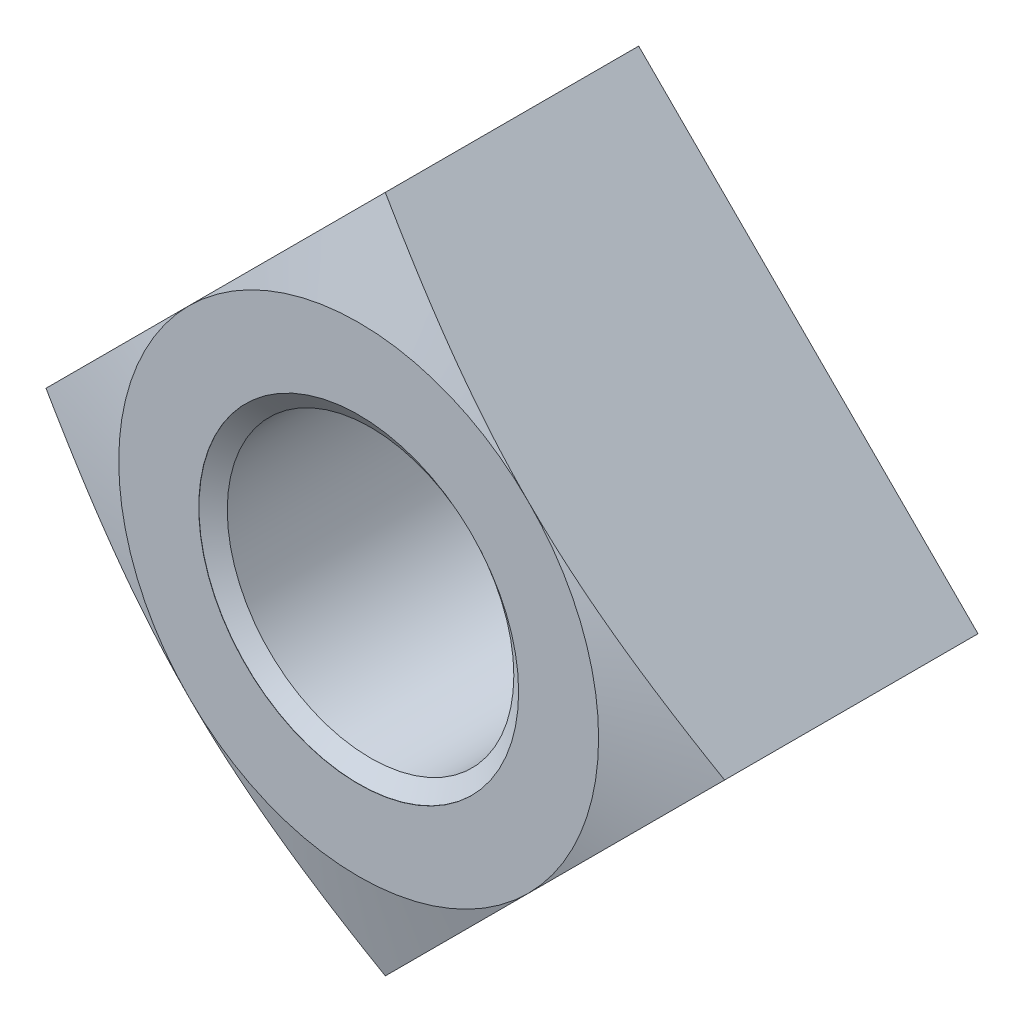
ISO-10303-21;
HEADER;
FILE_DESCRIPTION(('STEP AP214'),'2;1');
FILE_NAME('part.step','',(''),(''),'','','');
FILE_SCHEMA(('AUTOMOTIVE_DESIGN { 1 0 10303 214 1 1 1 1 }'));
ENDSEC;
DATA;
#1=APPLICATION_CONTEXT('core data for automotive mechanical design processes');
#2=APPLICATION_PROTOCOL_DEFINITION('international standard','automotive_design',2000,#1);
#3=PRODUCT_CONTEXT('',#1,'mechanical');
#4=PRODUCT('Part','Part','',(#3));
#5=PRODUCT_RELATED_PRODUCT_CATEGORY('part','',(#4));
#6=PRODUCT_DEFINITION_FORMATION('','',#4);
#7=PRODUCT_DEFINITION_CONTEXT('part definition',#1,'design');
#8=PRODUCT_DEFINITION('design','',#6,#7);
#9=PRODUCT_DEFINITION_SHAPE('','',#8);
#10=(LENGTH_UNIT() NAMED_UNIT(*) SI_UNIT(.MILLI.,.METRE.));
#11=(NAMED_UNIT(*) PLANE_ANGLE_UNIT() SI_UNIT($,.RADIAN.));
#12=(NAMED_UNIT(*) SI_UNIT($,.STERADIAN.) SOLID_ANGLE_UNIT());
#13=UNCERTAINTY_MEASURE_WITH_UNIT(LENGTH_MEASURE(1.E-05),#10,'distance_accuracy_value','');
#14=(GEOMETRIC_REPRESENTATION_CONTEXT(3) GLOBAL_UNCERTAINTY_ASSIGNED_CONTEXT((#13)) GLOBAL_UNIT_ASSIGNED_CONTEXT((#10,
#11,#12)) REPRESENTATION_CONTEXT('',''));
#15=CARTESIAN_POINT('',(0.,0.,0.));
#16=DIRECTION('',(0.,0.,1.));
#17=DIRECTION('',(1.,0.,0.));
#18=AXIS2_PLACEMENT_3D('',#15,#16,#17);
#19=CARTESIAN_POINT('',(40.4111525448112,0.,0.));
#20=DIRECTION('',(0.,0.,1.));
#21=DIRECTION('',(1.,0.,0.));
#22=AXIS2_PLACEMENT_3D('',#19,#20,#21);
#23=PLANE('',#22);
#24=CARTESIAN_POINT('',(0.,0.,0.));
#25=DIRECTION('',(0.,0.,1.));
#26=DIRECTION('',(1.,0.,0.));
#27=AXIS2_PLACEMENT_3D('',#24,#25,#26);
#28=CIRCLE('',#27,19.05);
#29=CARTESIAN_POINT('',(19.05,0.,0.));
#30=VERTEX_POINT('',#29);
#31=EDGE_CURVE('E204',#30,#30,#28,.T.);
#32=ORIENTED_EDGE('',*,*,#31,.F.);
#33=EDGE_LOOP('',(#32));
#34=FACE_BOUND('',#33,.T.);
#35=CARTESIAN_POINT('',(0.,0.,0.));
#36=DIRECTION('',(0.,0.,1.));
#37=DIRECTION('',(1.,0.,0.));
#38=AXIS2_PLACEMENT_3D('',#35,#36,#37);
#39=CIRCLE('',#38,28.575);
#40=CARTESIAN_POINT('',(20.2055762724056,-20.2055762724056,0.));
#41=VERTEX_POINT('',#40);
#42=CARTESIAN_POINT('',(20.2055762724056,20.2055762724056,0.));
#43=VERTEX_POINT('',#42);
#44=EDGE_CURVE('E52',#41,#43,#39,.T.);
#45=ORIENTED_EDGE('',*,*,#44,.T.);
#46=CARTESIAN_POINT('',(-20.2055762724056,20.2055762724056,0.));
#47=VERTEX_POINT('',#46);
#48=EDGE_CURVE('E100',#43,#47,#39,.T.);
#49=ORIENTED_EDGE('',*,*,#48,.T.);
#50=CARTESIAN_POINT('',(-20.2055762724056,-20.2055762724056,0.));
#51=VERTEX_POINT('',#50);
#52=EDGE_CURVE('E89',#47,#51,#39,.T.);
#53=ORIENTED_EDGE('',*,*,#52,.T.);
#54=EDGE_CURVE('E101',#51,#41,#39,.T.);
#55=ORIENTED_EDGE('',*,*,#54,.T.);
#56=EDGE_LOOP('',(#45,#49,#53,#55));
#57=FACE_BOUND('',#56,.T.);
#58=ADVANCED_FACE('F32',(#34,#57),#23,.T.);
#59=CARTESIAN_POINT('',(0.,-40.4111525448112,-33.3502));
#60=DIRECTION('',(0.707106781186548,-0.707106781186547,0.));
#61=DIRECTION('',(0.707106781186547,0.707106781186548,0.));
#62=AXIS2_PLACEMENT_3D('',#59,#60,#61);
#63=PLANE('',#62);
#64=DIRECTION('',(0.,0.,1.));
#65=VECTOR('',#64,1.);
#66=CARTESIAN_POINT('',(40.4111525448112,0.,-33.3502));
#67=LINE('',#66,#65);
#68=CARTESIAN_POINT('',(40.4111525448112,0.,-33.3502));
#69=VERTEX_POINT('',#68);
#70=CARTESIAN_POINT('',(40.4111525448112,0.,-3.17148751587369));
#71=VERTEX_POINT('',#70);
#72=EDGE_CURVE('E126',#69,#71,#67,.T.);
#73=ORIENTED_EDGE('',*,*,#72,.T.);
#74=CARTESIAN_POINT('',(40.4113525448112,0.000199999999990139,-3.17154110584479));
#75=CARTESIAN_POINT('',(39.8049108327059,-0.606241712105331,-3.00907310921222));
#76=CARTESIAN_POINT('',(39.1979948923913,-1.21315765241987,-2.85008038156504));
#77=CARTESIAN_POINT('',(37.9830969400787,-2.42805560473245,-2.54023632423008));
#78=CARTESIAN_POINT('',(37.3751148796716,-3.03603766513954,-2.38938537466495));
#79=CARTESIAN_POINT('',(36.1576234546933,-4.25352909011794,-2.09693498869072));
#80=CARTESIAN_POINT('',(35.5481133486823,-4.86303919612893,-1.95534170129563));
#81=CARTESIAN_POINT('',(34.3278938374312,-6.08325870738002,-1.68292515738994));
#82=CARTESIAN_POINT('',(33.7171844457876,-6.69396809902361,-1.55210177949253));
#83=CARTESIAN_POINT('',(32.4938208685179,-7.91733167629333,-1.302638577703));
#84=CARTESIAN_POINT('',(31.8811652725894,-8.52998727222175,-1.18401252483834));
#85=CARTESIAN_POINT('',(30.6545606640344,-9.75659188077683,-0.960801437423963));
#86=CARTESIAN_POINT('',(30.0406116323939,-10.3705409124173,-0.856216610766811));
#87=CARTESIAN_POINT('',(28.8115781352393,-11.5995744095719,-0.662871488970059));
#88=CARTESIAN_POINT('',(28.1964939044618,-12.2146586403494,-0.574108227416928));
#89=CARTESIAN_POINT('',(26.9651979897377,-13.4459545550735,-0.414126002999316));
#90=CARTESIAN_POINT('',(26.348986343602,-14.0621662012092,-0.342906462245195));
#91=CARTESIAN_POINT('',(25.1249196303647,-15.2862329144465,-0.220530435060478));
#92=CARTESIAN_POINT('',(24.517079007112,-15.8940735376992,-0.169087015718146));
#93=CARTESIAN_POINT('',(23.3007173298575,-17.1104352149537,-0.0859933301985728));
#94=CARTESIAN_POINT('',(22.6921962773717,-17.7189562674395,-0.0543430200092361));
#95=CARTESIAN_POINT('',(21.4747809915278,-18.9363715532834,-0.0116521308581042));
#96=CARTESIAN_POINT('',(20.8658867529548,-19.5452657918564,-0.0006118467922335));
#97=CARTESIAN_POINT('',(19.6480888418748,-20.7630637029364,0.000562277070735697));
#98=CARTESIAN_POINT('',(19.0391851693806,-21.3719673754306,-0.00930385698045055));
#99=CARTESIAN_POINT('',(17.8223388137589,-22.5888137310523,-0.0496574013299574));
#100=CARTESIAN_POINT('',(17.2143957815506,-23.1967567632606,-0.0801239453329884));
#101=CARTESIAN_POINT('',(15.9991691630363,-24.4119833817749,-0.160870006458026));
#102=CARTESIAN_POINT('',(15.3918855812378,-25.0192669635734,-0.21114965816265));
#103=CARTESIAN_POINT('',(14.1782458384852,-26.2329067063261,-0.330309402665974));
#104=CARTESIAN_POINT('',(13.5718896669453,-26.8392628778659,-0.399189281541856));
#105=CARTESIAN_POINT('',(12.3602697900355,-28.0508827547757,-0.554049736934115));
#106=CARTESIAN_POINT('',(11.7550060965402,-28.656146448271,-0.640030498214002));
#107=CARTESIAN_POINT('',(10.684359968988,-29.7267925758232,-0.805948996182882));
#108=CARTESIAN_POINT('',(10.2187321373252,-30.192420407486,-0.882750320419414));
#109=CARTESIAN_POINT('',(9.28824541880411,-31.1229071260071,-1.04475379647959));
#110=CARTESIAN_POINT('',(8.8233864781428,-31.5877660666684,-1.12995533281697));
#111=CARTESIAN_POINT('',(7.42979162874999,-32.9813609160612,-1.39704514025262));
#112=CARTESIAN_POINT('',(6.50214667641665,-33.9090058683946,-1.59040136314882));
#113=CARTESIAN_POINT('',(5.10983637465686,-35.3013161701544,-1.89982246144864));
#114=CARTESIAN_POINT('',(4.64411244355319,-35.767040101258,-2.00656403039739));
#115=CARTESIAN_POINT('',(3.71333417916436,-36.6978183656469,-2.22574783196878));
#116=CARTESIAN_POINT('',(3.24827984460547,-37.1628727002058,-2.33819005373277));
#117=CARTESIAN_POINT('',(2.31897604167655,-38.0921765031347,-2.56814637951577));
#118=CARTESIAN_POINT('',(1.85472634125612,-38.5564262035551,-2.68565861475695));
#119=CARTESIAN_POINT('',(0.926825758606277,-39.484326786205,-2.92527992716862));
#120=CARTESIAN_POINT('',(0.463174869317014,-39.9479776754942,-3.04738894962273));
#121=CARTESIAN_POINT('',(-0.000199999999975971,-40.4113525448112,-3.1715411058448));
#122=B_SPLINE_CURVE_WITH_KNOTS('',3,(#74,#75,#76,#77,#78,#79,#80,#81,#82,#83,#84,#85,#86,#87,
#88,#89,#90,#91,#92,#93,#94,#95,#96,#97,#98,#99,#100,#101,#102,#103,#104,#105,#106,#107,#108,
#109,#110,#111,#112,#113,#114,#115,#116,#117,#118,#119,#120,#121),.UNSPECIFIED.,.F.,.F.,(4,2,2,
2,2,2,2,2,2,2,2,2,2,2,2,2,2,2,2,2,2,2,2,4),(0.,2.61868429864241,5.23749075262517,
7.85801932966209,10.4785183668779,13.1019442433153,15.7254089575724,18.348381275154,
20.9712671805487,23.5545153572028,26.1377577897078,28.7210371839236,31.3043133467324,
33.8849768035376,36.4656577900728,39.0463090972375,41.6269882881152,43.6158142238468,
45.6044945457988,49.5823203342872,51.5839847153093,53.5856452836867,55.5865742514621,
57.5874794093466),.UNSPECIFIED.);
#123=EDGE_CURVE('E122',#71,#41,#122,.T.);
#124=ORIENTED_EDGE('',*,*,#123,.T.);
#125=CARTESIAN_POINT('',(0.,-40.4111525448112,-3.1714875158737));
#126=VERTEX_POINT('',#125);
#127=EDGE_CURVE('E118',#41,#126,#122,.T.);
#128=ORIENTED_EDGE('',*,*,#127,.T.);
#129=DIRECTION('',(0.,0.,1.));
#130=VECTOR('',#129,1.);
#131=CARTESIAN_POINT('',(0.,-40.4111525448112,-33.3502));
#132=LINE('',#131,#130);
#133=CARTESIAN_POINT('',(0.,-40.4111525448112,-33.3502));
#134=VERTEX_POINT('',#133);
#135=EDGE_CURVE('E218',#134,#126,#132,.T.);
#136=ORIENTED_EDGE('',*,*,#135,.F.);
#137=DIRECTION('',(0.707106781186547,0.707106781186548,0.));
#138=VECTOR('',#137,1.);
#139=CARTESIAN_POINT('',(0.,-40.4111525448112,-33.3502));
#140=LINE('',#139,#138);
#141=EDGE_CURVE('E208',#134,#69,#140,.T.);
#142=ORIENTED_EDGE('',*,*,#141,.T.);
#143=EDGE_LOOP('',(#73,#124,#128,#136,#142));
#144=FACE_BOUND('',#143,.T.);
#145=ADVANCED_FACE('F34',(#144),#63,.T.);
#146=CARTESIAN_POINT('',(-40.4111525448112,0.,-33.3502));
#147=DIRECTION('',(-0.707106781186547,-0.707106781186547,0.));
#148=DIRECTION('',(0.707106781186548,-0.707106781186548,0.));
#149=AXIS2_PLACEMENT_3D('',#146,#147,#148);
#150=PLANE('',#149);
#151=ORIENTED_EDGE('',*,*,#135,.T.);
#152=CARTESIAN_POINT('',(0.000200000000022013,-40.4113525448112,-3.1715411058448));
#153=CARTESIAN_POINT('',(-0.606241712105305,-39.8049108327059,-3.00907310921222));
#154=CARTESIAN_POINT('',(-1.21315765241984,-39.1979948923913,-2.85008038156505));
#155=CARTESIAN_POINT('',(-2.42805560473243,-37.9830969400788,-2.54023632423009));
#156=CARTESIAN_POINT('',(-3.03603766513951,-37.3751148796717,-2.38938537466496));
#157=CARTESIAN_POINT('',(-4.25352909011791,-36.1576234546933,-2.09693498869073));
#158=CARTESIAN_POINT('',(-4.8630391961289,-35.5481133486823,-1.95534170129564));
#159=CARTESIAN_POINT('',(-6.08325870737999,-34.3278938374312,-1.68292515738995));
#160=CARTESIAN_POINT('',(-6.69396809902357,-33.7171844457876,-1.55210177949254));
#161=CARTESIAN_POINT('',(-7.9173316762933,-32.4938208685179,-1.30263857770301));
#162=CARTESIAN_POINT('',(-8.52998727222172,-31.8811652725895,-1.18401252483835));
#163=CARTESIAN_POINT('',(-9.7565918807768,-30.6545606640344,-0.960801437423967));
#164=CARTESIAN_POINT('',(-10.3705409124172,-30.040611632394,-0.856216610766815));
#165=CARTESIAN_POINT('',(-11.5995744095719,-28.8115781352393,-0.662871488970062));
#166=CARTESIAN_POINT('',(-12.2146586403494,-28.1964939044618,-0.574108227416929));
#167=CARTESIAN_POINT('',(-13.4459545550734,-26.9651979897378,-0.414126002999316));
#168=CARTESIAN_POINT('',(-14.0621662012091,-26.348986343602,-0.342906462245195));
#169=CARTESIAN_POINT('',(-15.2862329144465,-25.1249196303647,-0.220530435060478));
#170=CARTESIAN_POINT('',(-15.8940735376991,-24.5170790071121,-0.169087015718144));
#171=CARTESIAN_POINT('',(-17.1104352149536,-23.3007173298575,-0.0859933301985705));
#172=CARTESIAN_POINT('',(-17.7189562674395,-22.6921962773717,-0.0543430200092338));
#173=CARTESIAN_POINT('',(-18.9363715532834,-21.4747809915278,-0.0116521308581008));
#174=CARTESIAN_POINT('',(-19.5452657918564,-20.8658867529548,-0.000611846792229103));
#175=CARTESIAN_POINT('',(-20.7630637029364,-19.6480888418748,0.000562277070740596));
#176=CARTESIAN_POINT('',(-21.3719673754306,-19.0391851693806,-0.00930385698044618));
#177=CARTESIAN_POINT('',(-22.5888137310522,-17.8223388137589,-0.0496574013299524));
#178=CARTESIAN_POINT('',(-23.1967567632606,-17.2143957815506,-0.0801239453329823));
#179=CARTESIAN_POINT('',(-24.4119833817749,-15.9991691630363,-0.160870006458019));
#180=CARTESIAN_POINT('',(-25.0192669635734,-15.3918855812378,-0.211149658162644));
#181=CARTESIAN_POINT('',(-26.232906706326,-14.1782458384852,-0.330309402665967));
#182=CARTESIAN_POINT('',(-26.8392628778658,-13.5718896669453,-0.399189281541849));
#183=CARTESIAN_POINT('',(-28.0508827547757,-12.3602697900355,-0.554049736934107));
#184=CARTESIAN_POINT('',(-28.656146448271,-11.7550060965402,-0.640030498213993));
#185=CARTESIAN_POINT('',(-29.7267925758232,-10.684359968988,-0.805948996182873));
#186=CARTESIAN_POINT('',(-30.192420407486,-10.2187321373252,-0.882750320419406));
#187=CARTESIAN_POINT('',(-31.1229071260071,-9.28824541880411,-1.04475379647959));
#188=CARTESIAN_POINT('',(-31.5877660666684,-8.8233864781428,-1.12995533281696));
#189=CARTESIAN_POINT('',(-32.9813609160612,-7.42979162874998,-1.39704514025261));
#190=CARTESIAN_POINT('',(-33.9090058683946,-6.50214667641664,-1.59040136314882));
#191=CARTESIAN_POINT('',(-35.3013161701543,-5.10983637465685,-1.89982246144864));
#192=CARTESIAN_POINT('',(-35.767040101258,-4.64411244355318,-2.00656403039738));
#193=CARTESIAN_POINT('',(-36.6978183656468,-3.71333417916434,-2.22574783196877));
#194=CARTESIAN_POINT('',(-37.1628727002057,-3.24827984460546,-2.33819005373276));
#195=CARTESIAN_POINT('',(-38.0921765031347,-2.31897604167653,-2.56814637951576));
#196=CARTESIAN_POINT('',(-38.5564262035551,-1.8547263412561,-2.68565861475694));
#197=CARTESIAN_POINT('',(-39.4843267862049,-0.92682575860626,-2.92527992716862));
#198=CARTESIAN_POINT('',(-39.9479776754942,-0.463174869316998,-3.04738894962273));
#199=CARTESIAN_POINT('',(-40.4113525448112,0.000199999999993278,-3.17154110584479));
#200=B_SPLINE_CURVE_WITH_KNOTS('',3,(#152,#153,#154,#155,#156,#157,#158,#159,#160,#161,#162,
#163,#164,#165,#166,#167,#168,#169,#170,#171,#172,#173,#174,#175,#176,#177,#178,#179,#180,#181,
#182,#183,#184,#185,#186,#187,#188,#189,#190,#191,#192,#193,#194,#195,#196,#197,#198,#199),
.UNSPECIFIED.,.F.,.F.,(4,2,2,2,2,2,2,2,2,2,2,2,2,2,2,2,2,2,2,2,2,2,2,4),(0.,2.61868429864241,
5.23749075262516,7.85801932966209,10.4785183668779,13.1019442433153,15.7254089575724,
18.348381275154,20.9712671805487,23.5545153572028,26.1377577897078,28.7210371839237,
31.3043133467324,33.8849768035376,36.4656577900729,39.0463090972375,41.6269882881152,
43.6158142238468,45.6044945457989,49.5823203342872,51.5839847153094,53.5856452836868,
55.5865742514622,57.5874794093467),.UNSPECIFIED.);
#201=EDGE_CURVE('E116',#126,#51,#200,.T.);
#202=ORIENTED_EDGE('',*,*,#201,.T.);
#203=CARTESIAN_POINT('',(-40.4111525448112,0.,-3.17148751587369));
#204=VERTEX_POINT('',#203);
#205=EDGE_CURVE('E95',#51,#204,#200,.T.);
#206=ORIENTED_EDGE('',*,*,#205,.T.);
#207=DIRECTION('',(0.,0.,1.));
#208=VECTOR('',#207,1.);
#209=CARTESIAN_POINT('',(-40.4111525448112,0.,-33.3502));
#210=LINE('',#209,#208);
#211=CARTESIAN_POINT('',(-40.4111525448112,0.,-33.3502));
#212=VERTEX_POINT('',#211);
#213=EDGE_CURVE('E113',#212,#204,#210,.T.);
#214=ORIENTED_EDGE('',*,*,#213,.F.);
#215=DIRECTION('',(0.707106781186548,-0.707106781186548,0.));
#216=VECTOR('',#215,1.);
#217=CARTESIAN_POINT('',(-40.4111525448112,0.,-33.3502));
#218=LINE('',#217,#216);
#219=EDGE_CURVE('E215',#212,#134,#218,.T.);
#220=ORIENTED_EDGE('',*,*,#219,.T.);
#221=EDGE_LOOP('',(#151,#202,#206,#214,#220));
#222=FACE_BOUND('',#221,.T.);
#223=ADVANCED_FACE('F156',(#222),#150,.T.);
#224=CARTESIAN_POINT('',(0.,40.4111525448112,-33.3502));
#225=DIRECTION('',(-0.707106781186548,0.707106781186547,0.));
#226=DIRECTION('',(-0.707106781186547,-0.707106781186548,0.));
#227=AXIS2_PLACEMENT_3D('',#224,#225,#226);
#228=PLANE('',#227);
#229=ORIENTED_EDGE('',*,*,#213,.T.);
#230=CARTESIAN_POINT('',(-40.4113525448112,-0.000200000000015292,-3.17154110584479));
#231=CARTESIAN_POINT('',(-39.8049108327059,0.606241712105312,-3.00907310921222));
#232=CARTESIAN_POINT('',(-39.1979948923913,1.21315765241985,-2.85008038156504));
#233=CARTESIAN_POINT('',(-37.9830969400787,2.42805560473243,-2.54023632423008));
#234=CARTESIAN_POINT('',(-37.3751148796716,3.03603766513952,-2.38938537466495));
#235=CARTESIAN_POINT('',(-36.1576234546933,4.25352909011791,-2.09693498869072));
#236=CARTESIAN_POINT('',(-35.5481133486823,4.8630391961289,-1.95534170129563));
#237=CARTESIAN_POINT('',(-34.3278938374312,6.08325870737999,-1.68292515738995));
#238=CARTESIAN_POINT('',(-33.7171844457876,6.69396809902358,-1.55210177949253));
#239=CARTESIAN_POINT('',(-32.4938208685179,7.9173316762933,-1.30263857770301));
#240=CARTESIAN_POINT('',(-31.8811652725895,8.52998727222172,-1.18401252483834));
#241=CARTESIAN_POINT('',(-30.6545606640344,9.7565918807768,-0.960801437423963));
#242=CARTESIAN_POINT('',(-30.0406116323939,10.3705409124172,-0.85621661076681));
#243=CARTESIAN_POINT('',(-28.8115781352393,11.5995744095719,-0.662871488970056));
#244=CARTESIAN_POINT('',(-28.1964939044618,12.2146586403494,-0.574108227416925));
#245=CARTESIAN_POINT('',(-26.9651979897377,13.4459545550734,-0.414126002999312));
#246=CARTESIAN_POINT('',(-26.348986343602,14.0621662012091,-0.342906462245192));
#247=CARTESIAN_POINT('',(-25.1249196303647,15.2862329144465,-0.220530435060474));
#248=CARTESIAN_POINT('',(-24.517079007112,15.8940735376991,-0.16908701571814));
#249=CARTESIAN_POINT('',(-23.3007173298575,17.1104352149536,-0.085993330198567));
#250=CARTESIAN_POINT('',(-22.6921962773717,17.7189562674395,-0.0543430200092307));
#251=CARTESIAN_POINT('',(-21.4747809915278,18.9363715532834,-0.0116521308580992));
#252=CARTESIAN_POINT('',(-20.8658867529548,19.5452657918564,-0.000611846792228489));
#253=CARTESIAN_POINT('',(-19.6480888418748,20.7630637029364,0.000562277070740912));
#254=CARTESIAN_POINT('',(-19.0391851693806,21.3719673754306,-0.00930385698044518));
#255=CARTESIAN_POINT('',(-17.8223388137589,22.5888137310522,-0.0496574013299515));
#256=CARTESIAN_POINT('',(-17.2143957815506,23.1967567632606,-0.0801239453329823));
#257=CARTESIAN_POINT('',(-15.9991691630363,24.4119833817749,-0.160870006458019));
#258=CARTESIAN_POINT('',(-15.3918855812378,25.0192669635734,-0.211149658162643));
#259=CARTESIAN_POINT('',(-14.1782458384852,26.232906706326,-0.330309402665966));
#260=CARTESIAN_POINT('',(-13.5718896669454,26.8392628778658,-0.399189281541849));
#261=CARTESIAN_POINT('',(-12.3602697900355,28.0508827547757,-0.554049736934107));
#262=CARTESIAN_POINT('',(-11.7550060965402,28.656146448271,-0.640030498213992));
#263=CARTESIAN_POINT('',(-10.684359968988,29.7267925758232,-0.805948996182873));
#264=CARTESIAN_POINT('',(-10.2187321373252,30.192420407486,-0.882750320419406));
#265=CARTESIAN_POINT('',(-9.28824541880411,31.1229071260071,-1.04475379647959));
#266=CARTESIAN_POINT('',(-8.8233864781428,31.5877660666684,-1.12995533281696));
#267=CARTESIAN_POINT('',(-7.42979162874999,32.9813609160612,-1.39704514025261));
#268=CARTESIAN_POINT('',(-6.50214667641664,33.9090058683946,-1.59040136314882));
#269=CARTESIAN_POINT('',(-5.10983637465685,35.3013161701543,-1.89982246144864));
#270=CARTESIAN_POINT('',(-4.64411244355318,35.767040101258,-2.00656403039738));
#271=CARTESIAN_POINT('',(-3.71333417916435,36.6978183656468,-2.22574783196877));
#272=CARTESIAN_POINT('',(-3.24827984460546,37.1628727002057,-2.33819005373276));
#273=CARTESIAN_POINT('',(-2.31897604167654,38.0921765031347,-2.56814637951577));
#274=CARTESIAN_POINT('',(-1.8547263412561,38.5564262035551,-2.68565861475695));
#275=CARTESIAN_POINT('',(-0.926825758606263,39.4843267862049,-2.92527992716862));
#276=CARTESIAN_POINT('',(-0.463174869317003,39.9479776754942,-3.04738894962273));
#277=CARTESIAN_POINT('',(0.000199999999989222,40.4113525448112,-3.17154110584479));
#278=B_SPLINE_CURVE_WITH_KNOTS('',3,(#230,#231,#232,#233,#234,#235,#236,#237,#238,#239,#240,
#241,#242,#243,#244,#245,#246,#247,#248,#249,#250,#251,#252,#253,#254,#255,#256,#257,#258,#259,
#260,#261,#262,#263,#264,#265,#266,#267,#268,#269,#270,#271,#272,#273,#274,#275,#276,#277),
.UNSPECIFIED.,.F.,.F.,(4,2,2,2,2,2,2,2,2,2,2,2,2,2,2,2,2,2,2,2,2,2,2,4),(0.,2.61868429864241,
5.23749075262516,7.85801932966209,10.4785183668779,13.1019442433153,15.7254089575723,
18.348381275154,20.9712671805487,23.5545153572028,26.1377577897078,28.7210371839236,
31.3043133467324,33.8849768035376,36.4656577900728,39.0463090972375,41.6269882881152,
43.6158142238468,45.6044945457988,49.5823203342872,51.5839847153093,53.5856452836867,
55.5865742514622,57.5874794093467),.UNSPECIFIED.);
#279=EDGE_CURVE('E93',#204,#47,#278,.T.);
#280=ORIENTED_EDGE('',*,*,#279,.T.);
#281=CARTESIAN_POINT('',(0.,40.4111525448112,-3.1714875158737));
#282=VERTEX_POINT('',#281);
#283=EDGE_CURVE('E106',#47,#282,#278,.T.);
#284=ORIENTED_EDGE('',*,*,#283,.T.);
#285=DIRECTION('',(0.,0.,1.));
#286=VECTOR('',#285,1.);
#287=CARTESIAN_POINT('',(0.,40.4111525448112,-33.3502));
#288=LINE('',#287,#286);
#289=CARTESIAN_POINT('',(0.,40.4111525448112,-33.3502));
#290=VERTEX_POINT('',#289);
#291=EDGE_CURVE('E221',#290,#282,#288,.T.);
#292=ORIENTED_EDGE('',*,*,#291,.F.);
#293=DIRECTION('',(-0.707106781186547,-0.707106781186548,0.));
#294=VECTOR('',#293,1.);
#295=CARTESIAN_POINT('',(0.,40.4111525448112,-33.3502));
#296=LINE('',#295,#294);
#297=EDGE_CURVE('E213',#290,#212,#296,.T.);
#298=ORIENTED_EDGE('',*,*,#297,.T.);
#299=EDGE_LOOP('',(#229,#280,#284,#292,#298));
#300=FACE_BOUND('',#299,.T.);
#301=ADVANCED_FACE('F111',(#300),#228,.T.);
#302=CARTESIAN_POINT('',(40.4111525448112,0.,-33.3502));
#303=DIRECTION('',(0.707106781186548,0.707106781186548,0.));
#304=DIRECTION('',(-0.707106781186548,0.707106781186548,0.));
#305=AXIS2_PLACEMENT_3D('',#302,#303,#304);
#306=PLANE('',#305);
#307=ORIENTED_EDGE('',*,*,#291,.T.);
#308=CARTESIAN_POINT('',(-0.000200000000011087,40.4113525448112,-3.17154110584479));
#309=CARTESIAN_POINT('',(0.606241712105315,39.8049108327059,-3.00907310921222));
#310=CARTESIAN_POINT('',(1.21315765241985,39.1979948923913,-2.85008038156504));
#311=CARTESIAN_POINT('',(2.42805560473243,37.9830969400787,-2.54023632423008));
#312=CARTESIAN_POINT('',(3.03603766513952,37.3751148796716,-2.38938537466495));
#313=CARTESIAN_POINT('',(4.25352909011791,36.1576234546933,-2.09693498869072));
#314=CARTESIAN_POINT('',(4.86303919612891,35.5481133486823,-1.95534170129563));
#315=CARTESIAN_POINT('',(6.08325870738,34.3278938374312,-1.68292515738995));
#316=CARTESIAN_POINT('',(6.69396809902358,33.7171844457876,-1.55210177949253));
#317=CARTESIAN_POINT('',(7.91733167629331,32.4938208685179,-1.302638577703));
#318=CARTESIAN_POINT('',(8.52998727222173,31.8811652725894,-1.18401252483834));
#319=CARTESIAN_POINT('',(9.7565918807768,30.6545606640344,-0.960801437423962));
#320=CARTESIAN_POINT('',(10.3705409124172,30.0406116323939,-0.85621661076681));
#321=CARTESIAN_POINT('',(11.5995744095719,28.8115781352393,-0.662871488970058));
#322=CARTESIAN_POINT('',(12.2146586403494,28.1964939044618,-0.574108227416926));
#323=CARTESIAN_POINT('',(13.4459545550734,26.9651979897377,-0.414126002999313));
#324=CARTESIAN_POINT('',(14.0621662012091,26.348986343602,-0.342906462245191));
#325=CARTESIAN_POINT('',(15.2862329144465,25.1249196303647,-0.220530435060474));
#326=CARTESIAN_POINT('',(15.8940735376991,24.517079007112,-0.169087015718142));
#327=CARTESIAN_POINT('',(17.1104352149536,23.3007173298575,-0.0859933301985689));
#328=CARTESIAN_POINT('',(17.7189562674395,22.6921962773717,-0.0543430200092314));
#329=CARTESIAN_POINT('',(18.9363715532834,21.4747809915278,-0.0116521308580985));
#330=CARTESIAN_POINT('',(19.5452657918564,20.8658867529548,-0.000611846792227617));
#331=CARTESIAN_POINT('',(20.7630637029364,19.6480888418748,0.000562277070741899));
#332=CARTESIAN_POINT('',(21.3719673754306,19.0391851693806,-0.00930385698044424));
#333=CARTESIAN_POINT('',(22.5888137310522,17.8223388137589,-0.0496574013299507));
#334=CARTESIAN_POINT('',(23.1967567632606,17.2143957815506,-0.0801239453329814));
#335=CARTESIAN_POINT('',(24.4119833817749,15.9991691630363,-0.160870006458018));
#336=CARTESIAN_POINT('',(25.0192669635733,15.3918855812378,-0.211149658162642));
#337=CARTESIAN_POINT('',(26.232906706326,14.1782458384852,-0.330309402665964));
#338=CARTESIAN_POINT('',(26.8392628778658,13.5718896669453,-0.399189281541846));
#339=CARTESIAN_POINT('',(28.0508827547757,12.3602697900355,-0.554049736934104));
#340=CARTESIAN_POINT('',(28.656146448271,11.7550060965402,-0.64003049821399));
#341=CARTESIAN_POINT('',(29.7267925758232,10.684359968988,-0.805948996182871));
#342=CARTESIAN_POINT('',(30.192420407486,10.2187321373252,-0.882750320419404));
#343=CARTESIAN_POINT('',(31.1229071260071,9.2882454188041,-1.04475379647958));
#344=CARTESIAN_POINT('',(31.5877660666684,8.82338647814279,-1.12995533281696));
#345=CARTESIAN_POINT('',(32.9813609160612,7.42979162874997,-1.39704514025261));
#346=CARTESIAN_POINT('',(33.9090058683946,6.50214667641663,-1.59040136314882));
#347=CARTESIAN_POINT('',(35.3013161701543,5.10983637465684,-1.89982246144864));
#348=CARTESIAN_POINT('',(35.767040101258,4.64411244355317,-2.00656403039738));
#349=CARTESIAN_POINT('',(36.6978183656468,3.71333417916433,-2.22574783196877));
#350=CARTESIAN_POINT('',(37.1628727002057,3.24827984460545,-2.33819005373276));
#351=CARTESIAN_POINT('',(38.0921765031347,2.31897604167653,-2.56814637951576));
#352=CARTESIAN_POINT('',(38.5564262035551,1.85472634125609,-2.68565861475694));
#353=CARTESIAN_POINT('',(39.4843267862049,0.926825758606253,-2.92527992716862));
#354=CARTESIAN_POINT('',(39.9479776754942,0.46317486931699,-3.04738894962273));
#355=CARTESIAN_POINT('',(40.4113525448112,-0.000200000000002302,-3.17154110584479));
#356=B_SPLINE_CURVE_WITH_KNOTS('',3,(#308,#309,#310,#311,#312,#313,#314,#315,#316,#317,#318,
#319,#320,#321,#322,#323,#324,#325,#326,#327,#328,#329,#330,#331,#332,#333,#334,#335,#336,#337,
#338,#339,#340,#341,#342,#343,#344,#345,#346,#347,#348,#349,#350,#351,#352,#353,#354,#355),
.UNSPECIFIED.,.F.,.F.,(4,2,2,2,2,2,2,2,2,2,2,2,2,2,2,2,2,2,2,2,2,2,2,4),(0.,2.61868429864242,
5.23749075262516,7.85801932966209,10.4785183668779,13.1019442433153,15.7254089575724,
18.348381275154,20.9712671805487,23.5545153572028,26.1377577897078,28.7210371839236,
31.3043133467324,33.8849768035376,36.4656577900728,39.0463090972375,41.6269882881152,
43.6158142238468,45.6044945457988,49.5823203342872,51.5839847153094,53.5856452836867,
55.5865742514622,57.5874794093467),.UNSPECIFIED.);
#357=EDGE_CURVE('E11',#282,#43,#356,.T.);
#358=ORIENTED_EDGE('',*,*,#357,.T.);
#359=EDGE_CURVE('E37',#43,#71,#356,.T.);
#360=ORIENTED_EDGE('',*,*,#359,.T.);
#361=ORIENTED_EDGE('',*,*,#72,.F.);
#362=DIRECTION('',(-0.707106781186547,0.707106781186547,0.));
#363=VECTOR('',#362,1.);
#364=CARTESIAN_POINT('',(40.4111525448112,0.,-33.3502));
#365=LINE('',#364,#363);
#366=EDGE_CURVE('E210',#69,#290,#365,.T.);
#367=ORIENTED_EDGE('',*,*,#366,.T.);
#368=EDGE_LOOP('',(#307,#358,#360,#361,#367));
#369=FACE_BOUND('',#368,.T.);
#370=ADVANCED_FACE('F155',(#369),#306,.T.);
#371=CARTESIAN_POINT('',(0.,0.,-33.3502));
#372=DIRECTION('',(0.,0.,1.));
#373=DIRECTION('',(1.,0.,0.));
#374=AXIS2_PLACEMENT_3D('',#371,#372,#373);
#375=CYLINDRICAL_SURFACE('',#374,17.06626);
#376=CARTESIAN_POINT('',(0.,0.,-1.41391378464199));
#377=DIRECTION('',(0.,0.,1.));
#378=DIRECTION('',(1.,0.,0.));
#379=AXIS2_PLACEMENT_3D('',#376,#377,#378);
#380=CIRCLE('',#379,17.06626);
#381=CARTESIAN_POINT('',(17.06626,0.,-1.41391378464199));
#382=VERTEX_POINT('',#381);
#383=EDGE_CURVE('E207',#382,#382,#380,.F.);
#384=ORIENTED_EDGE('',*,*,#383,.F.);
#385=EDGE_LOOP('',(#384));
#386=FACE_BOUND('',#385,.T.);
#387=CARTESIAN_POINT('',(0.,0.,-31.936286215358));
#388=DIRECTION('',(0.,0.,-1.));
#389=DIRECTION('',(-1.,0.,0.));
#390=AXIS2_PLACEMENT_3D('',#387,#388,#389);
#391=CIRCLE('',#390,17.06626);
#392=CARTESIAN_POINT('',(-17.06626,0.,-31.936286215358));
#393=VERTEX_POINT('',#392);
#394=EDGE_CURVE('E198',#393,#393,#391,.F.);
#395=ORIENTED_EDGE('',*,*,#394,.F.);
#396=EDGE_LOOP('',(#395));
#397=FACE_BOUND('',#396,.T.);
#398=ADVANCED_FACE('F161',(#386,#397),#375,.F.);
#399=CARTESIAN_POINT('',(40.4111525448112,0.,-33.3502));
#400=DIRECTION('',(0.,0.,1.));
#401=DIRECTION('',(1.,0.,0.));
#402=AXIS2_PLACEMENT_3D('',#399,#400,#401);
#403=PLANE('',#402);
#404=ORIENTED_EDGE('',*,*,#141,.F.);
#405=ORIENTED_EDGE('',*,*,#219,.F.);
#406=ORIENTED_EDGE('',*,*,#297,.F.);
#407=ORIENTED_EDGE('',*,*,#366,.F.);
#408=EDGE_LOOP('',(#404,#405,#406,#407));
#409=FACE_BOUND('',#408,.T.);
#410=CARTESIAN_POINT('',(0.,0.,-33.3502));
#411=DIRECTION('',(0.,0.,1.));
#412=DIRECTION('',(1.,0.,0.));
#413=AXIS2_PLACEMENT_3D('',#410,#411,#412);
#414=CIRCLE('',#413,19.05);
#415=CARTESIAN_POINT('',(19.05,0.,-33.3502));
#416=VERTEX_POINT('',#415);
#417=EDGE_CURVE('E129',#416,#416,#414,.T.);
#418=ORIENTED_EDGE('',*,*,#417,.T.);
#419=EDGE_LOOP('',(#418));
#420=FACE_BOUND('',#419,.T.);
#421=ADVANCED_FACE('F165',(#409,#420),#403,.F.);
#422=CARTESIAN_POINT('',(0.,0.,-1.5527651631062));
#423=DIRECTION('',(0.,0.,1.));
#424=DIRECTION('',(1.,0.,0.));
#425=AXIS2_PLACEMENT_3D('',#422,#423,#424);
#426=CONICAL_SURFACE('',#425,16.867886,0.960105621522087);
#427=CARTESIAN_POINT('',(0.,0.,-0.0254000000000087));
#428=DIRECTION('',(0.,0.,1.));
#429=DIRECTION('',(1.,0.,0.));
#430=AXIS2_PLACEMENT_3D('',#427,#428,#429);
#431=CIRCLE('',#430,19.05);
#432=CARTESIAN_POINT('',(19.05,0.,-0.0254000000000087));
#433=VERTEX_POINT('',#432);
#434=EDGE_CURVE('E200',#433,#433,#431,.T.);
#435=ORIENTED_EDGE('',*,*,#434,.T.);
#436=EDGE_LOOP('',(#435));
#437=FACE_BOUND('',#436,.T.);
#438=ORIENTED_EDGE('',*,*,#383,.T.);
#439=EDGE_LOOP('',(#438));
#440=FACE_BOUND('',#439,.T.);
#441=ADVANCED_FACE('F176',(#437,#440),#426,.F.);
#442=CARTESIAN_POINT('',(0.,0.,-25.0375057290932));
#443=DIRECTION('',(0.,0.,1.));
#444=DIRECTION('',(1.,0.,0.));
#445=AXIS2_PLACEMENT_3D('',#442,#443,#444);
#446=CYLINDRICAL_SURFACE('',#445,19.05);
#447=ORIENTED_EDGE('',*,*,#31,.T.);
#448=EDGE_LOOP('',(#447));
#449=FACE_BOUND('',#448,.T.);
#450=ORIENTED_EDGE('',*,*,#434,.F.);
#451=EDGE_LOOP('',(#450));
#452=FACE_BOUND('',#451,.T.);
#453=ADVANCED_FACE('F179',(#449,#452),#446,.F.);
#454=CARTESIAN_POINT('',(0.,0.,-33.3248));
#455=DIRECTION('',(0.,0.,-1.));
#456=DIRECTION('',(-1.,0.,0.));
#457=AXIS2_PLACEMENT_3D('',#454,#455,#456);
#458=CONICAL_SURFACE('',#457,19.05,0.96010562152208);
#459=CARTESIAN_POINT('',(0.,0.,-33.3248));
#460=DIRECTION('',(0.,0.,1.));
#461=DIRECTION('',(1.,0.,0.));
#462=AXIS2_PLACEMENT_3D('',#459,#460,#461);
#463=CIRCLE('',#462,19.05);
#464=CARTESIAN_POINT('',(19.05,0.,-33.3248));
#465=VERTEX_POINT('',#464);
#466=EDGE_CURVE('E127',#465,#465,#463,.T.);
#467=ORIENTED_EDGE('',*,*,#466,.F.);
#468=EDGE_LOOP('',(#467));
#469=FACE_BOUND('',#468,.T.);
#470=ORIENTED_EDGE('',*,*,#394,.T.);
#471=EDGE_LOOP('',(#470));
#472=FACE_BOUND('',#471,.T.);
#473=ADVANCED_FACE('F144',(#469,#472),#458,.F.);
#474=CARTESIAN_POINT('',(0.,0.,-25.0375057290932));
#475=DIRECTION('',(0.,0.,1.));
#476=DIRECTION('',(1.,0.,0.));
#477=AXIS2_PLACEMENT_3D('',#474,#475,#476);
#478=CYLINDRICAL_SURFACE('',#477,19.05);
#479=ORIENTED_EDGE('',*,*,#466,.T.);
#480=EDGE_LOOP('',(#479));
#481=FACE_BOUND('',#480,.T.);
#482=ORIENTED_EDGE('',*,*,#417,.F.);
#483=EDGE_LOOP('',(#482));
#484=FACE_BOUND('',#483,.T.);
#485=ADVANCED_FACE('F185',(#481,#484),#478,.F.);
#486=CARTESIAN_POINT('',(0.,0.,0.));
#487=DIRECTION('',(0.,0.,-1.));
#488=DIRECTION('',(-1.,0.,0.));
#489=AXIS2_PLACEMENT_3D('',#486,#487,#488);
#490=CONICAL_SURFACE('',#489,28.575,1.30899693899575);
#491=ORIENTED_EDGE('',*,*,#359,.F.);
#492=ORIENTED_EDGE('',*,*,#44,.F.);
#493=ORIENTED_EDGE('',*,*,#123,.F.);
#494=EDGE_LOOP('',(#491,#492,#493));
#495=FACE_BOUND('',#494,.T.);
#496=ADVANCED_FACE('F143',(#495),#490,.T.);
#497=ORIENTED_EDGE('',*,*,#48,.F.);
#498=ORIENTED_EDGE('',*,*,#357,.F.);
#499=ORIENTED_EDGE('',*,*,#283,.F.);
#500=EDGE_LOOP('',(#497,#498,#499));
#501=FACE_BOUND('',#500,.T.);
#502=ADVANCED_FACE('F107',(#501),#490,.T.);
#503=ORIENTED_EDGE('',*,*,#52,.F.);
#504=ORIENTED_EDGE('',*,*,#279,.F.);
#505=ORIENTED_EDGE('',*,*,#205,.F.);
#506=EDGE_LOOP('',(#503,#504,#505));
#507=FACE_BOUND('',#506,.T.);
#508=ADVANCED_FACE('F91',(#507),#490,.T.);
#509=ORIENTED_EDGE('',*,*,#54,.F.);
#510=ORIENTED_EDGE('',*,*,#201,.F.);
#511=ORIENTED_EDGE('',*,*,#127,.F.);
#512=EDGE_LOOP('',(#509,#510,#511));
#513=FACE_BOUND('',#512,.T.);
#514=ADVANCED_FACE('F115',(#513),#490,.T.);
#515=CLOSED_SHELL('',(#58,#145,#223,#301,#370,#398,#421,#441,#453,#473,#485,#496,#502,#508,#514));
#516=MANIFOLD_SOLID_BREP('B2',#515);
#517=ADVANCED_BREP_SHAPE_REPRESENTATION('',(#18,#516),#14);
#518=SHAPE_DEFINITION_REPRESENTATION(#9,#517);
ENDSEC;
END-ISO-10303-21;
